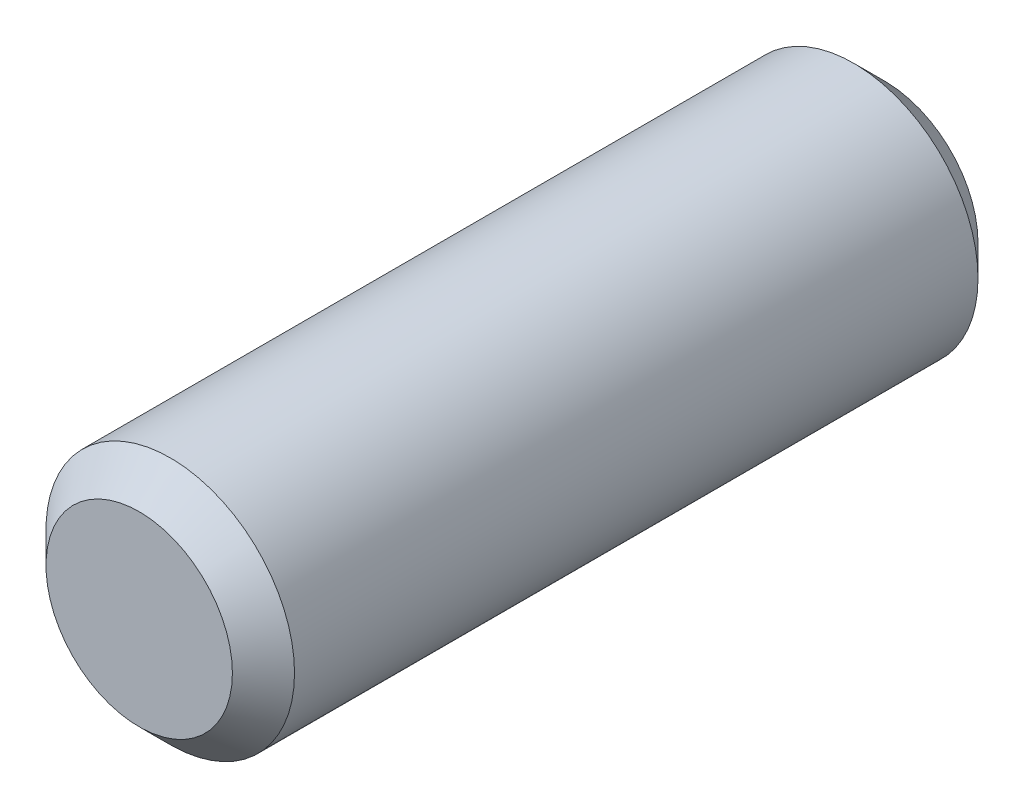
from build123d import *


with BuildPart() as part:
    # Sketch1 → Revolve1 (revolve)
    with BuildSketch(Plane(origin=(0, 0, 0), x_dir=(0, 0, -1), z_dir=(1, 0, 0)), mode=Mode.PRIVATE) as revolve1_sk:
        Polygon((0, 0), (6, 0), (6, 0.749986), (5.749986, 1), (0.250014, 1), (0, 0.749986), align=None)
    revolve(revolve1_sk.sketch.rotate(Axis((0, 0, -10.674691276), (0, 0, -1)), 90), axis=Axis((0, 0, -10.674691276), (0, 0, -1)))


solid = part.part
